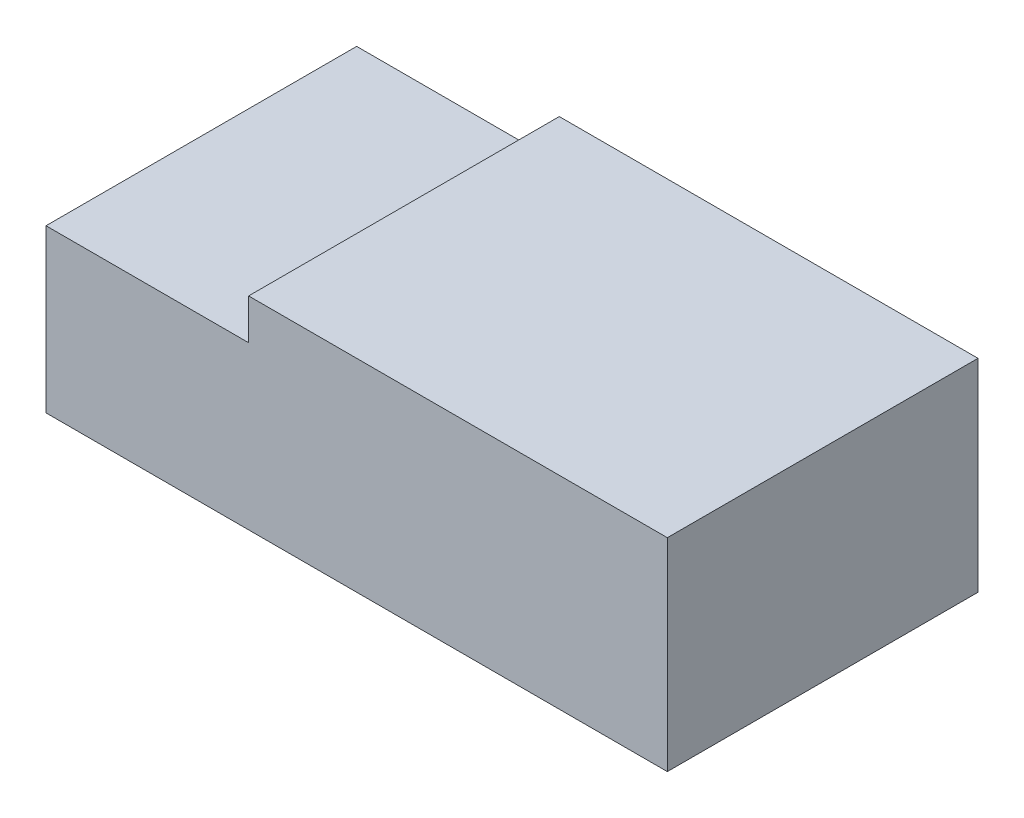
ISO-10303-21;
HEADER;
FILE_DESCRIPTION(('STEP AP214'),'2;1');
FILE_NAME('part.step','',(''),(''),'','','');
FILE_SCHEMA(('AUTOMOTIVE_DESIGN { 1 0 10303 214 1 1 1 1 }'));
ENDSEC;
DATA;
#1=APPLICATION_CONTEXT('core data for automotive mechanical design processes');
#2=APPLICATION_PROTOCOL_DEFINITION('international standard','automotive_design',2000,#1);
#3=PRODUCT_CONTEXT('',#1,'mechanical');
#4=PRODUCT('Part','Part','',(#3));
#5=PRODUCT_RELATED_PRODUCT_CATEGORY('part','',(#4));
#6=PRODUCT_DEFINITION_FORMATION('','',#4);
#7=PRODUCT_DEFINITION_CONTEXT('part definition',#1,'design');
#8=PRODUCT_DEFINITION('design','',#6,#7);
#9=PRODUCT_DEFINITION_SHAPE('','',#8);
#10=(LENGTH_UNIT() NAMED_UNIT(*) SI_UNIT(.MILLI.,.METRE.));
#11=(NAMED_UNIT(*) PLANE_ANGLE_UNIT() SI_UNIT($,.RADIAN.));
#12=(NAMED_UNIT(*) SI_UNIT($,.STERADIAN.) SOLID_ANGLE_UNIT());
#13=UNCERTAINTY_MEASURE_WITH_UNIT(LENGTH_MEASURE(1.E-05),#10,'distance_accuracy_value','');
#14=(GEOMETRIC_REPRESENTATION_CONTEXT(3) GLOBAL_UNCERTAINTY_ASSIGNED_CONTEXT((#13)) GLOBAL_UNIT_ASSIGNED_CONTEXT((#10,
#11,#12)) REPRESENTATION_CONTEXT('',''));
#15=CARTESIAN_POINT('',(0.,0.,0.));
#16=DIRECTION('',(0.,0.,1.));
#17=DIRECTION('',(1.,0.,0.));
#18=AXIS2_PLACEMENT_3D('',#15,#16,#17);
#19=CARTESIAN_POINT('',(-115.,37.5,-57.5));
#20=DIRECTION('',(1.,0.,0.));
#21=DIRECTION('',(0.,0.,-1.));
#22=AXIS2_PLACEMENT_3D('',#19,#20,#21);
#23=PLANE('',#22);
#24=DIRECTION('',(0.,0.,1.));
#25=VECTOR('',#24,1.);
#26=CARTESIAN_POINT('',(-115.,22.5,-57.5));
#27=LINE('',#26,#25);
#28=CARTESIAN_POINT('',(-115.,22.5,-57.5));
#29=VERTEX_POINT('',#28);
#30=CARTESIAN_POINT('',(-115.,22.5,57.5));
#31=VERTEX_POINT('',#30);
#32=EDGE_CURVE('E114',#29,#31,#27,.T.);
#33=ORIENTED_EDGE('',*,*,#32,.F.);
#34=DIRECTION('',(0.,-1.,0.));
#35=VECTOR('',#34,1.);
#36=CARTESIAN_POINT('',(-115.,37.5,-57.5));
#37=LINE('',#36,#35);
#38=CARTESIAN_POINT('',(-115.,-37.5,-57.5));
#39=VERTEX_POINT('',#38);
#40=EDGE_CURVE('E44',#29,#39,#37,.T.);
#41=ORIENTED_EDGE('',*,*,#40,.T.);
#42=DIRECTION('',(0.,0.,1.));
#43=VECTOR('',#42,1.);
#44=CARTESIAN_POINT('',(-115.,-37.5,-57.5));
#45=LINE('',#44,#43);
#46=CARTESIAN_POINT('',(-115.,-37.5,57.5));
#47=VERTEX_POINT('',#46);
#48=EDGE_CURVE('E91',#39,#47,#45,.T.);
#49=ORIENTED_EDGE('',*,*,#48,.T.);
#50=DIRECTION('',(0.,-1.,0.));
#51=VECTOR('',#50,1.);
#52=CARTESIAN_POINT('',(-115.,37.5,57.5));
#53=LINE('',#52,#51);
#54=EDGE_CURVE('E85',#31,#47,#53,.T.);
#55=ORIENTED_EDGE('',*,*,#54,.F.);
#56=EDGE_LOOP('',(#33,#41,#49,#55));
#57=FACE_BOUND('',#56,.T.);
#58=ADVANCED_FACE('F36',(#57),#23,.F.);
#59=CARTESIAN_POINT('',(115.,37.5,-57.5));
#60=DIRECTION('',(-1.,0.,0.));
#61=DIRECTION('',(0.,0.,1.));
#62=AXIS2_PLACEMENT_3D('',#59,#60,#61);
#63=PLANE('',#62);
#64=DIRECTION('',(0.,0.,-1.));
#65=VECTOR('',#64,1.);
#66=CARTESIAN_POINT('',(115.,-37.5,-57.5));
#67=LINE('',#66,#65);
#68=CARTESIAN_POINT('',(115.,-37.5,57.5));
#69=VERTEX_POINT('',#68);
#70=CARTESIAN_POINT('',(115.,-37.5,-57.5));
#71=VERTEX_POINT('',#70);
#72=EDGE_CURVE('E96',#69,#71,#67,.T.);
#73=ORIENTED_EDGE('',*,*,#72,.T.);
#74=DIRECTION('',(0.,-1.,0.));
#75=VECTOR('',#74,1.);
#76=CARTESIAN_POINT('',(115.,37.5,-57.5));
#77=LINE('',#76,#75);
#78=CARTESIAN_POINT('',(115.,37.5,-57.5));
#79=VERTEX_POINT('',#78);
#80=EDGE_CURVE('E11',#79,#71,#77,.T.);
#81=ORIENTED_EDGE('',*,*,#80,.F.);
#82=DIRECTION('',(0.,0.,-1.));
#83=VECTOR('',#82,1.);
#84=CARTESIAN_POINT('',(115.,37.5,-57.5));
#85=LINE('',#84,#83);
#86=CARTESIAN_POINT('',(115.,37.5,57.5));
#87=VERTEX_POINT('',#86);
#88=EDGE_CURVE('E90',#87,#79,#85,.T.);
#89=ORIENTED_EDGE('',*,*,#88,.F.);
#90=DIRECTION('',(0.,-1.,0.));
#91=VECTOR('',#90,1.);
#92=CARTESIAN_POINT('',(115.,37.5,57.5));
#93=LINE('',#92,#91);
#94=EDGE_CURVE('E81',#87,#69,#93,.T.);
#95=ORIENTED_EDGE('',*,*,#94,.T.);
#96=EDGE_LOOP('',(#73,#81,#89,#95));
#97=FACE_BOUND('',#96,.T.);
#98=ADVANCED_FACE('F38',(#97),#63,.F.);
#99=CARTESIAN_POINT('',(-115.,37.5,-57.5));
#100=DIRECTION('',(0.,0.,1.));
#101=DIRECTION('',(1.,0.,0.));
#102=AXIS2_PLACEMENT_3D('',#99,#100,#101);
#103=PLANE('',#102);
#104=DIRECTION('',(-1.,0.,0.));
#105=VECTOR('',#104,1.);
#106=CARTESIAN_POINT('',(-115.,22.5,-57.5));
#107=LINE('',#106,#105);
#108=CARTESIAN_POINT('',(-40.,22.5,-57.5));
#109=VERTEX_POINT('',#108);
#110=EDGE_CURVE('E125',#109,#29,#107,.T.);
#111=ORIENTED_EDGE('',*,*,#110,.F.);
#112=DIRECTION('',(0.,1.,0.));
#113=VECTOR('',#112,1.);
#114=CARTESIAN_POINT('',(-40.,22.5,-57.5));
#115=LINE('',#114,#113);
#116=CARTESIAN_POINT('',(-40.,37.5,-57.5));
#117=VERTEX_POINT('',#116);
#118=EDGE_CURVE('E101',#109,#117,#115,.T.);
#119=ORIENTED_EDGE('',*,*,#118,.T.);
#120=DIRECTION('',(-1.,0.,0.));
#121=VECTOR('',#120,1.);
#122=CARTESIAN_POINT('',(-115.,37.5,-57.5));
#123=LINE('',#122,#121);
#124=EDGE_CURVE('E119',#79,#117,#123,.T.);
#125=ORIENTED_EDGE('',*,*,#124,.F.);
#126=ORIENTED_EDGE('',*,*,#80,.T.);
#127=DIRECTION('',(-1.,0.,0.));
#128=VECTOR('',#127,1.);
#129=CARTESIAN_POINT('',(-115.,-37.5,-57.5));
#130=LINE('',#129,#128);
#131=EDGE_CURVE('E100',#71,#39,#130,.T.);
#132=ORIENTED_EDGE('',*,*,#131,.T.);
#133=ORIENTED_EDGE('',*,*,#40,.F.);
#134=EDGE_LOOP('',(#111,#119,#125,#126,#132,#133));
#135=FACE_BOUND('',#134,.T.);
#136=ADVANCED_FACE('F117',(#135),#103,.F.);
#137=CARTESIAN_POINT('',(-115.,37.5,57.5));
#138=DIRECTION('',(0.,0.,-1.));
#139=DIRECTION('',(-1.,0.,0.));
#140=AXIS2_PLACEMENT_3D('',#137,#138,#139);
#141=PLANE('',#140);
#142=DIRECTION('',(1.,0.,0.));
#143=VECTOR('',#142,1.);
#144=CARTESIAN_POINT('',(-115.,37.5,57.5));
#145=LINE('',#144,#143);
#146=CARTESIAN_POINT('',(-40.,37.5,57.5));
#147=VERTEX_POINT('',#146);
#148=EDGE_CURVE('E59',#147,#87,#145,.T.);
#149=ORIENTED_EDGE('',*,*,#148,.F.);
#150=DIRECTION('',(0.,1.,0.));
#151=VECTOR('',#150,1.);
#152=CARTESIAN_POINT('',(-40.,22.5,57.5));
#153=LINE('',#152,#151);
#154=CARTESIAN_POINT('',(-40.,22.5,57.5));
#155=VERTEX_POINT('',#154);
#156=EDGE_CURVE('E51',#155,#147,#153,.T.);
#157=ORIENTED_EDGE('',*,*,#156,.F.);
#158=DIRECTION('',(1.,0.,0.));
#159=VECTOR('',#158,1.);
#160=CARTESIAN_POINT('',(-115.,22.5,57.5));
#161=LINE('',#160,#159);
#162=EDGE_CURVE('E134',#31,#155,#161,.T.);
#163=ORIENTED_EDGE('',*,*,#162,.F.);
#164=ORIENTED_EDGE('',*,*,#54,.T.);
#165=DIRECTION('',(1.,0.,0.));
#166=VECTOR('',#165,1.);
#167=CARTESIAN_POINT('',(-115.,-37.5,57.5));
#168=LINE('',#167,#166);
#169=EDGE_CURVE('E78',#47,#69,#168,.T.);
#170=ORIENTED_EDGE('',*,*,#169,.T.);
#171=ORIENTED_EDGE('',*,*,#94,.F.);
#172=EDGE_LOOP('',(#149,#157,#163,#164,#170,#171));
#173=FACE_BOUND('',#172,.T.);
#174=ADVANCED_FACE('F80',(#173),#141,.F.);
#175=CARTESIAN_POINT('',(0.,37.5,0.));
#176=DIRECTION('',(0.,1.,0.));
#177=DIRECTION('',(0.,0.,1.));
#178=AXIS2_PLACEMENT_3D('',#175,#176,#177);
#179=PLANE('',#178);
#180=DIRECTION('',(0.,0.,-1.));
#181=VECTOR('',#180,1.);
#182=CARTESIAN_POINT('',(-40.,37.5,-57.5));
#183=LINE('',#182,#181);
#184=EDGE_CURVE('E127',#147,#117,#183,.T.);
#185=ORIENTED_EDGE('',*,*,#184,.F.);
#186=ORIENTED_EDGE('',*,*,#148,.T.);
#187=ORIENTED_EDGE('',*,*,#88,.T.);
#188=ORIENTED_EDGE('',*,*,#124,.T.);
#189=EDGE_LOOP('',(#185,#186,#187,#188));
#190=FACE_BOUND('',#189,.T.);
#191=ADVANCED_FACE('F122',(#190),#179,.T.);
#192=CARTESIAN_POINT('',(0.,-37.5,0.));
#193=DIRECTION('',(0.,1.,0.));
#194=DIRECTION('',(0.,0.,1.));
#195=AXIS2_PLACEMENT_3D('',#192,#193,#194);
#196=PLANE('',#195);
#197=ORIENTED_EDGE('',*,*,#72,.F.);
#198=ORIENTED_EDGE('',*,*,#169,.F.);
#199=ORIENTED_EDGE('',*,*,#48,.F.);
#200=ORIENTED_EDGE('',*,*,#131,.F.);
#201=EDGE_LOOP('',(#197,#198,#199,#200));
#202=FACE_BOUND('',#201,.T.);
#203=ADVANCED_FACE('F98',(#202),#196,.F.);
#204=CARTESIAN_POINT('',(-40.,22.5,-57.5));
#205=DIRECTION('',(1.,0.,0.));
#206=DIRECTION('',(0.,0.,-1.));
#207=AXIS2_PLACEMENT_3D('',#204,#205,#206);
#208=PLANE('',#207);
#209=ORIENTED_EDGE('',*,*,#184,.T.);
#210=ORIENTED_EDGE('',*,*,#118,.F.);
#211=DIRECTION('',(0.,0.,-1.));
#212=VECTOR('',#211,1.);
#213=CARTESIAN_POINT('',(-40.,22.5,-57.5));
#214=LINE('',#213,#212);
#215=EDGE_CURVE('E131',#155,#109,#214,.T.);
#216=ORIENTED_EDGE('',*,*,#215,.F.);
#217=ORIENTED_EDGE('',*,*,#156,.T.);
#218=EDGE_LOOP('',(#209,#210,#216,#217));
#219=FACE_BOUND('',#218,.T.);
#220=ADVANCED_FACE('F146',(#219),#208,.F.);
#221=CARTESIAN_POINT('',(0.,22.5,0.));
#222=DIRECTION('',(0.,1.,0.));
#223=DIRECTION('',(0.,0.,1.));
#224=AXIS2_PLACEMENT_3D('',#221,#222,#223);
#225=PLANE('',#224);
#226=ORIENTED_EDGE('',*,*,#32,.T.);
#227=ORIENTED_EDGE('',*,*,#162,.T.);
#228=ORIENTED_EDGE('',*,*,#215,.T.);
#229=ORIENTED_EDGE('',*,*,#110,.T.);
#230=EDGE_LOOP('',(#226,#227,#228,#229));
#231=FACE_BOUND('',#230,.T.);
#232=ADVANCED_FACE('F139',(#231),#225,.T.);
#233=CLOSED_SHELL('',(#58,#98,#136,#174,#191,#203,#220,#232));
#234=MANIFOLD_SOLID_BREP('B2',#233);
#235=ADVANCED_BREP_SHAPE_REPRESENTATION('',(#18,#234),#14);
#236=SHAPE_DEFINITION_REPRESENTATION(#9,#235);
ENDSEC;
END-ISO-10303-21;
